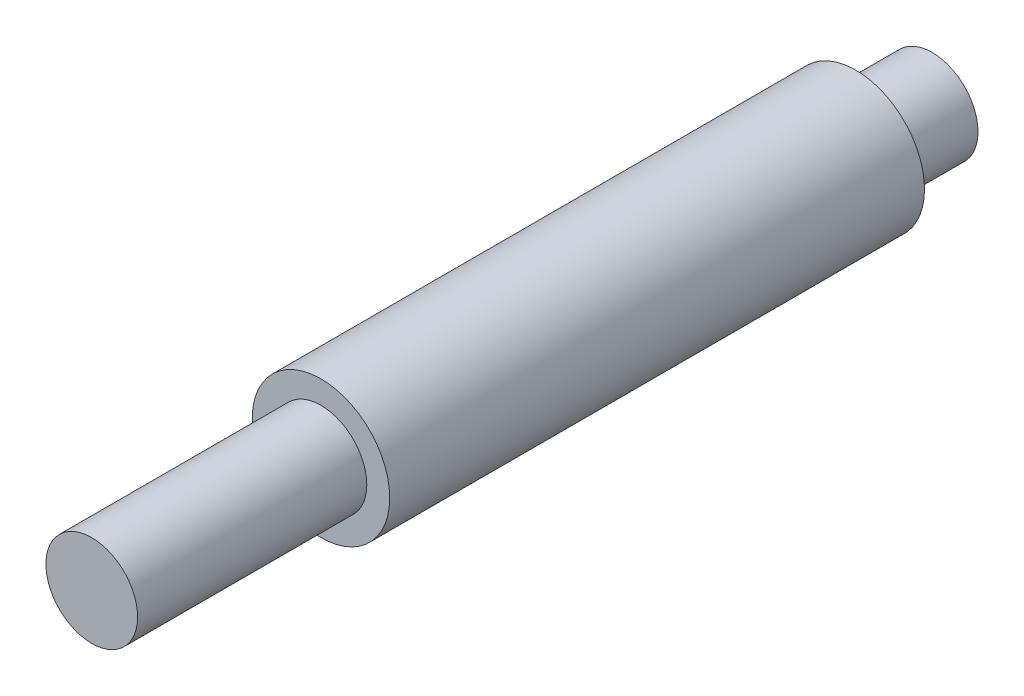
ISO-10303-21;
HEADER;
FILE_DESCRIPTION(('STEP AP214'),'2;1');
FILE_NAME('part.step','',(''),(''),'','','');
FILE_SCHEMA(('AUTOMOTIVE_DESIGN { 1 0 10303 214 1 1 1 1 }'));
ENDSEC;
DATA;
#1=APPLICATION_CONTEXT('core data for automotive mechanical design processes');
#2=APPLICATION_PROTOCOL_DEFINITION('international standard','automotive_design',2000,#1);
#3=PRODUCT_CONTEXT('',#1,'mechanical');
#4=PRODUCT('Part','Part','',(#3));
#5=PRODUCT_RELATED_PRODUCT_CATEGORY('part','',(#4));
#6=PRODUCT_DEFINITION_FORMATION('','',#4);
#7=PRODUCT_DEFINITION_CONTEXT('part definition',#1,'design');
#8=PRODUCT_DEFINITION('design','',#6,#7);
#9=PRODUCT_DEFINITION_SHAPE('','',#8);
#10=(LENGTH_UNIT() NAMED_UNIT(*) SI_UNIT(.MILLI.,.METRE.));
#11=(NAMED_UNIT(*) PLANE_ANGLE_UNIT() SI_UNIT($,.RADIAN.));
#12=(NAMED_UNIT(*) SI_UNIT($,.STERADIAN.) SOLID_ANGLE_UNIT());
#13=UNCERTAINTY_MEASURE_WITH_UNIT(LENGTH_MEASURE(1.E-05),#10,'distance_accuracy_value','');
#14=(GEOMETRIC_REPRESENTATION_CONTEXT(3) GLOBAL_UNCERTAINTY_ASSIGNED_CONTEXT((#13)) GLOBAL_UNIT_ASSIGNED_CONTEXT((#10,
#11,#12)) REPRESENTATION_CONTEXT('',''));
#15=CARTESIAN_POINT('',(0.,0.,0.));
#16=DIRECTION('',(0.,0.,1.));
#17=DIRECTION('',(1.,0.,0.));
#18=AXIS2_PLACEMENT_3D('',#15,#16,#17);
#19=CARTESIAN_POINT('',(0.,0.,10.));
#20=DIRECTION('',(0.,0.,-1.));
#21=DIRECTION('',(-1.,0.,0.));
#22=AXIS2_PLACEMENT_3D('',#19,#20,#21);
#23=CYLINDRICAL_SURFACE('',#22,6.);
#24=CARTESIAN_POINT('',(0.,0.,10.));
#25=DIRECTION('',(0.,0.,1.));
#26=DIRECTION('',(1.,0.,0.));
#27=AXIS2_PLACEMENT_3D('',#24,#25,#26);
#28=CIRCLE('',#27,6.);
#29=CARTESIAN_POINT('',(6.,0.,10.));
#30=VERTEX_POINT('',#29);
#31=EDGE_CURVE('E10',#30,#30,#28,.T.);
#32=ORIENTED_EDGE('',*,*,#31,.F.);
#33=EDGE_LOOP('',(#32));
#34=FACE_BOUND('',#33,.T.);
#35=CARTESIAN_POINT('',(0.,0.,0.));
#36=DIRECTION('',(0.,0.,1.));
#37=DIRECTION('',(1.,0.,0.));
#38=AXIS2_PLACEMENT_3D('',#35,#36,#37);
#39=CIRCLE('',#38,6.);
#40=CARTESIAN_POINT('',(6.,0.,0.));
#41=VERTEX_POINT('',#40);
#42=EDGE_CURVE('E38',#41,#41,#39,.T.);
#43=ORIENTED_EDGE('',*,*,#42,.T.);
#44=EDGE_LOOP('',(#43));
#45=FACE_BOUND('',#44,.T.);
#46=ADVANCED_FACE('F35',(#34,#45),#23,.T.);
#47=CARTESIAN_POINT('',(0.,0.,0.));
#48=DIRECTION('',(0.,0.,1.));
#49=DIRECTION('',(1.,0.,0.));
#50=AXIS2_PLACEMENT_3D('',#47,#48,#49);
#51=PLANE('',#50);
#52=ORIENTED_EDGE('',*,*,#42,.F.);
#53=EDGE_LOOP('',(#52));
#54=FACE_BOUND('',#53,.T.);
#55=ADVANCED_FACE('F77',(#54),#51,.F.);
#56=CARTESIAN_POINT('',(0.,0.,80.));
#57=DIRECTION('',(0.,0.,-1.));
#58=DIRECTION('',(-1.,0.,0.));
#59=AXIS2_PLACEMENT_3D('',#56,#57,#58);
#60=CYLINDRICAL_SURFACE('',#59,9.);
#61=CARTESIAN_POINT('',(0.,0.,80.));
#62=DIRECTION('',(0.,0.,1.));
#63=DIRECTION('',(1.,0.,0.));
#64=AXIS2_PLACEMENT_3D('',#61,#62,#63);
#65=CIRCLE('',#64,9.);
#66=CARTESIAN_POINT('',(9.,0.,80.));
#67=VERTEX_POINT('',#66);
#68=EDGE_CURVE('E45',#67,#67,#65,.T.);
#69=ORIENTED_EDGE('',*,*,#68,.F.);
#70=EDGE_LOOP('',(#69));
#71=FACE_BOUND('',#70,.T.);
#72=CARTESIAN_POINT('',(0.,0.,10.));
#73=DIRECTION('',(0.,0.,1.));
#74=DIRECTION('',(1.,0.,0.));
#75=AXIS2_PLACEMENT_3D('',#72,#73,#74);
#76=CIRCLE('',#75,9.);
#77=CARTESIAN_POINT('',(9.,0.,10.));
#78=VERTEX_POINT('',#77);
#79=EDGE_CURVE('E47',#78,#78,#76,.T.);
#80=ORIENTED_EDGE('',*,*,#79,.T.);
#81=EDGE_LOOP('',(#80));
#82=FACE_BOUND('',#81,.T.);
#83=ADVANCED_FACE('F71',(#71,#82),#60,.T.);
#84=CARTESIAN_POINT('',(0.,0.,80.));
#85=DIRECTION('',(0.,0.,1.));
#86=DIRECTION('',(1.,0.,0.));
#87=AXIS2_PLACEMENT_3D('',#84,#85,#86);
#88=PLANE('',#87);
#89=CARTESIAN_POINT('',(0.,0.,80.));
#90=DIRECTION('',(0.,0.,1.));
#91=DIRECTION('',(1.,0.,0.));
#92=AXIS2_PLACEMENT_3D('',#89,#90,#91);
#93=CIRCLE('',#92,6.);
#94=CARTESIAN_POINT('',(6.,0.,80.));
#95=VERTEX_POINT('',#94);
#96=EDGE_CURVE('E53',#95,#95,#93,.T.);
#97=ORIENTED_EDGE('',*,*,#96,.F.);
#98=EDGE_LOOP('',(#97));
#99=FACE_BOUND('',#98,.T.);
#100=ORIENTED_EDGE('',*,*,#68,.T.);
#101=EDGE_LOOP('',(#100));
#102=FACE_BOUND('',#101,.T.);
#103=ADVANCED_FACE('F68',(#99,#102),#88,.T.);
#104=CARTESIAN_POINT('',(0.,0.,10.));
#105=DIRECTION('',(0.,0.,1.));
#106=DIRECTION('',(1.,0.,0.));
#107=AXIS2_PLACEMENT_3D('',#104,#105,#106);
#108=PLANE('',#107);
#109=ORIENTED_EDGE('',*,*,#31,.T.);
#110=EDGE_LOOP('',(#109));
#111=FACE_BOUND('',#110,.T.);
#112=ORIENTED_EDGE('',*,*,#79,.F.);
#113=EDGE_LOOP('',(#112));
#114=FACE_BOUND('',#113,.T.);
#115=ADVANCED_FACE('F64',(#111,#114),#108,.F.);
#116=CARTESIAN_POINT('',(0.,0.,110.));
#117=DIRECTION('',(0.,0.,-1.));
#118=DIRECTION('',(-1.,0.,0.));
#119=AXIS2_PLACEMENT_3D('',#116,#117,#118);
#120=CYLINDRICAL_SURFACE('',#119,6.);
#121=CARTESIAN_POINT('',(0.,0.,110.));
#122=DIRECTION('',(0.,0.,1.));
#123=DIRECTION('',(1.,0.,0.));
#124=AXIS2_PLACEMENT_3D('',#121,#122,#123);
#125=CIRCLE('',#124,6.);
#126=CARTESIAN_POINT('',(6.,0.,110.));
#127=VERTEX_POINT('',#126);
#128=EDGE_CURVE('E50',#127,#127,#125,.T.);
#129=ORIENTED_EDGE('',*,*,#128,.F.);
#130=EDGE_LOOP('',(#129));
#131=FACE_BOUND('',#130,.T.);
#132=ORIENTED_EDGE('',*,*,#96,.T.);
#133=EDGE_LOOP('',(#132));
#134=FACE_BOUND('',#133,.T.);
#135=ADVANCED_FACE('F61',(#131,#134),#120,.T.);
#136=CARTESIAN_POINT('',(0.,0.,110.));
#137=DIRECTION('',(0.,0.,1.));
#138=DIRECTION('',(1.,0.,0.));
#139=AXIS2_PLACEMENT_3D('',#136,#137,#138);
#140=PLANE('',#139);
#141=ORIENTED_EDGE('',*,*,#128,.T.);
#142=EDGE_LOOP('',(#141));
#143=FACE_BOUND('',#142,.T.);
#144=ADVANCED_FACE('F59',(#143),#140,.T.);
#145=CLOSED_SHELL('',(#46,#55,#83,#103,#115,#135,#144));
#146=MANIFOLD_SOLID_BREP('B2',#145);
#147=ADVANCED_BREP_SHAPE_REPRESENTATION('',(#18,#146),#14);
#148=SHAPE_DEFINITION_REPRESENTATION(#9,#147);
ENDSEC;
END-ISO-10303-21;
